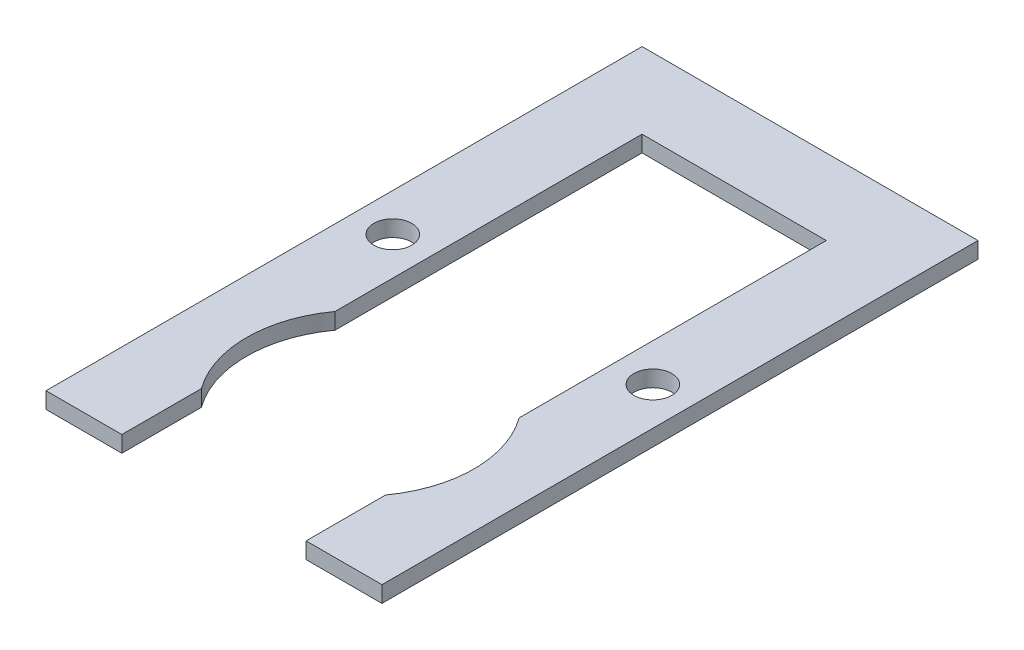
from build123d import *

# Parameters (mm, degrees)
SKETCH1_R      = 3.5
EXTRUDE1_DEPTH = 3


with BuildPart() as part:
    # Sketch1 → Extrude1 (new body)
    with BuildSketch(Plane(origin=(0, 0, 0), x_dir=(1, 0, 0), z_dir=(0, 1, 0))):
        with BuildLine():
            Line((0, 0), (14, 0))
            Line((14, 0), (14, 14.671171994))
            ThreePointArc((14, 14.671171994), (10, 27), (14, 39.328828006))
            Line((14, 39.328828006), (14, 96))
            Line((14, 96), (48, 96))
            Line((48, 96), (48, 39.328828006))
            ThreePointArc((48, 39.328828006), (52, 27), (48, 14.671171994))
            Line((48, 14.671171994), (48, 0))
            Line((48, 0), (62, 0))
            Line((62, 0), (62, 110))
            Line((62, 110), (0, 110))
            Line((0, 110), (0, 0))
        make_face()
        with Locations(Location((7, 57, 0), (0, 0, 270))):
            Circle(SKETCH1_R, mode=Mode.SUBTRACT)
        with Locations(Location((55, 57, 0), (0, 0, 270))):
            Circle(SKETCH1_R, mode=Mode.SUBTRACT)
    extrude(amount=EXTRUDE1_DEPTH)


solid = part.part
